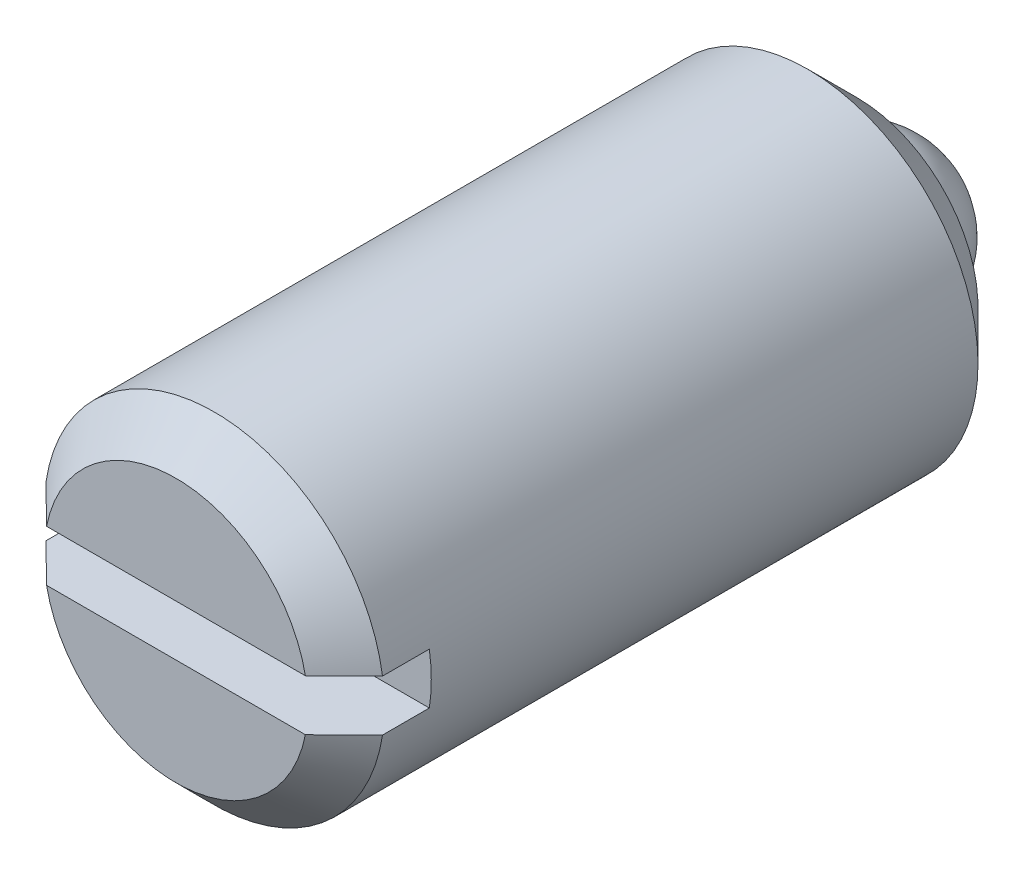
ISO-10303-21;
HEADER;
FILE_DESCRIPTION(('STEP AP214'),'2;1');
FILE_NAME('part.step','',(''),(''),'','','');
FILE_SCHEMA(('AUTOMOTIVE_DESIGN { 1 0 10303 214 1 1 1 1 }'));
ENDSEC;
DATA;
#1=APPLICATION_CONTEXT('core data for automotive mechanical design processes');
#2=APPLICATION_PROTOCOL_DEFINITION('international standard','automotive_design',2000,#1);
#3=PRODUCT_CONTEXT('',#1,'mechanical');
#4=PRODUCT('Part','Part','',(#3));
#5=PRODUCT_RELATED_PRODUCT_CATEGORY('part','',(#4));
#6=PRODUCT_DEFINITION_FORMATION('','',#4);
#7=PRODUCT_DEFINITION_CONTEXT('part definition',#1,'design');
#8=PRODUCT_DEFINITION('design','',#6,#7);
#9=PRODUCT_DEFINITION_SHAPE('','',#8);
#10=(LENGTH_UNIT() NAMED_UNIT(*) SI_UNIT(.MILLI.,.METRE.));
#11=(NAMED_UNIT(*) PLANE_ANGLE_UNIT() SI_UNIT($,.RADIAN.));
#12=(NAMED_UNIT(*) SI_UNIT($,.STERADIAN.) SOLID_ANGLE_UNIT());
#13=UNCERTAINTY_MEASURE_WITH_UNIT(LENGTH_MEASURE(1.E-05),#10,'distance_accuracy_value','');
#14=(GEOMETRIC_REPRESENTATION_CONTEXT(3) GLOBAL_UNCERTAINTY_ASSIGNED_CONTEXT((#13)) GLOBAL_UNIT_ASSIGNED_CONTEXT((#10,
#11,#12)) REPRESENTATION_CONTEXT('',''));
#15=CARTESIAN_POINT('',(0.,0.,0.));
#16=DIRECTION('',(0.,0.,1.));
#17=DIRECTION('',(1.,0.,0.));
#18=AXIS2_PLACEMENT_3D('',#15,#16,#17);
#19=CARTESIAN_POINT('',(0.,4.,18.));
#20=DIRECTION('',(0.,0.,1.));
#21=DIRECTION('',(1.,0.,0.));
#22=AXIS2_PLACEMENT_3D('',#19,#20,#21);
#23=PLANE('',#22);
#24=DIRECTION('',(1.,0.,0.));
#25=VECTOR('',#24,1.);
#26=CARTESIAN_POINT('',(-3.95474398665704,0.6,18.));
#27=LINE('',#26,#25);
#28=CARTESIAN_POINT('',(-3.04138126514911,0.6,18.));
#29=VERTEX_POINT('',#28);
#30=CARTESIAN_POINT('',(3.04138126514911,0.6,18.));
#31=VERTEX_POINT('',#30);
#32=EDGE_CURVE('E75',#29,#31,#27,.T.);
#33=ORIENTED_EDGE('',*,*,#32,.T.);
#34=CARTESIAN_POINT('',(0.,0.,18.));
#35=DIRECTION('',(0.,0.,1.));
#36=DIRECTION('',(0.,-1.,0.));
#37=AXIS2_PLACEMENT_3D('',#34,#35,#36);
#38=CIRCLE('',#37,3.1);
#39=EDGE_CURVE('E164',#31,#29,#38,.T.);
#40=ORIENTED_EDGE('',*,*,#39,.T.);
#41=EDGE_LOOP('',(#33,#40));
#42=FACE_BOUND('',#41,.T.);
#43=ADVANCED_FACE('F14',(#42),#23,.T.);
#44=CARTESIAN_POINT('',(0.,0.,-8.));
#45=DIRECTION('',(0.,0.,-1.));
#46=DIRECTION('',(-1.,0.,0.));
#47=AXIS2_PLACEMENT_3D('',#44,#45,#46);
#48=CYLINDRICAL_SURFACE('',#47,4.);
#49=CARTESIAN_POINT('',(0.,0.,3.15));
#50=DIRECTION('',(0.,0.,-1.));
#51=DIRECTION('',(0.,1.,0.));
#52=AXIS2_PLACEMENT_3D('',#49,#50,#51);
#53=CIRCLE('',#52,4.);
#54=CARTESIAN_POINT('',(0.,4.,3.15));
#55=VERTEX_POINT('',#54);
#56=EDGE_CURVE('E103',#55,#55,#53,.F.);
#57=ORIENTED_EDGE('',*,*,#56,.T.);
#58=EDGE_LOOP('',(#57));
#59=FACE_BOUND('',#58,.T.);
#60=DIRECTION('',(0.,0.,1.));
#61=VECTOR('',#60,1.);
#62=CARTESIAN_POINT('',(-3.95474398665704,0.6,16.));
#63=LINE('',#62,#61);
#64=CARTESIAN_POINT('',(-3.95474398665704,0.6,16.));
#65=VERTEX_POINT('',#64);
#66=CARTESIAN_POINT('',(-3.95474398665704,0.6,17.1));
#67=VERTEX_POINT('',#66);
#68=EDGE_CURVE('E95',#65,#67,#63,.T.);
#69=ORIENTED_EDGE('',*,*,#68,.T.);
#70=CARTESIAN_POINT('',(0.,0.,17.1));
#71=DIRECTION('',(0.,0.,1.));
#72=DIRECTION('',(0.,-1.,0.));
#73=AXIS2_PLACEMENT_3D('',#70,#71,#72);
#74=CIRCLE('',#73,4.);
#75=CARTESIAN_POINT('',(3.95474398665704,0.6,17.1));
#76=VERTEX_POINT('',#75);
#77=EDGE_CURVE('E107',#67,#76,#74,.F.);
#78=ORIENTED_EDGE('',*,*,#77,.T.);
#79=DIRECTION('',(0.,0.,1.));
#80=VECTOR('',#79,1.);
#81=CARTESIAN_POINT('',(3.95474398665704,0.6,16.));
#82=LINE('',#81,#80);
#83=CARTESIAN_POINT('',(3.95474398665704,0.6,16.));
#84=VERTEX_POINT('',#83);
#85=EDGE_CURVE('E89',#84,#76,#82,.T.);
#86=ORIENTED_EDGE('',*,*,#85,.F.);
#87=CARTESIAN_POINT('',(0.,0.,16.));
#88=DIRECTION('',(0.,0.,1.));
#89=DIRECTION('',(1.,0.,0.));
#90=AXIS2_PLACEMENT_3D('',#87,#88,#89);
#91=CIRCLE('',#90,4.);
#92=CARTESIAN_POINT('',(3.95474398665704,-0.6,16.));
#93=VERTEX_POINT('',#92);
#94=EDGE_CURVE('E77',#93,#84,#91,.T.);
#95=ORIENTED_EDGE('',*,*,#94,.F.);
#96=DIRECTION('',(0.,0.,1.));
#97=VECTOR('',#96,1.);
#98=CARTESIAN_POINT('',(3.95474398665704,-0.6,16.));
#99=LINE('',#98,#97);
#100=CARTESIAN_POINT('',(3.95474398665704,-0.6,17.1));
#101=VERTEX_POINT('',#100);
#102=EDGE_CURVE('E81',#93,#101,#99,.T.);
#103=ORIENTED_EDGE('',*,*,#102,.T.);
#104=CARTESIAN_POINT('',(0.,0.,17.1));
#105=DIRECTION('',(0.,0.,1.));
#106=DIRECTION('',(0.,-1.,0.));
#107=AXIS2_PLACEMENT_3D('',#104,#105,#106);
#108=CIRCLE('',#107,4.);
#109=CARTESIAN_POINT('',(-3.95474398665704,-0.6,17.1));
#110=VERTEX_POINT('',#109);
#111=EDGE_CURVE('E87',#101,#110,#108,.F.);
#112=ORIENTED_EDGE('',*,*,#111,.T.);
#113=DIRECTION('',(0.,0.,1.));
#114=VECTOR('',#113,1.);
#115=CARTESIAN_POINT('',(-3.95474398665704,-0.6,16.));
#116=LINE('',#115,#114);
#117=CARTESIAN_POINT('',(-3.95474398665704,-0.6,16.));
#118=VERTEX_POINT('',#117);
#119=EDGE_CURVE('E79',#118,#110,#116,.T.);
#120=ORIENTED_EDGE('',*,*,#119,.F.);
#121=EDGE_CURVE('E65',#65,#118,#91,.T.);
#122=ORIENTED_EDGE('',*,*,#121,.F.);
#123=EDGE_LOOP('',(#69,#78,#86,#95,#103,#112,#120,#122));
#124=FACE_BOUND('',#123,.T.);
#125=ADVANCED_FACE('F85',(#59,#124),#48,.T.);
#126=CARTESIAN_POINT('',(0.,0.,2.));
#127=DIRECTION('',(-1.,0.,0.));
#128=DIRECTION('',(0.,0.,1.));
#129=AXIS2_PLACEMENT_3D('',#126,#127,#128);
#130=SPHERICAL_SURFACE('',#129,2.);
#131=CARTESIAN_POINT('',(0.,0.,2.));
#132=DIRECTION('',(0.,0.,-1.));
#133=DIRECTION('',(-1.,0.,0.));
#134=AXIS2_PLACEMENT_3D('',#131,#132,#133);
#135=SPHERICAL_SURFACE('',#134,2.);
#136=CARTESIAN_POINT('',(0.,0.,2.));
#137=DIRECTION('',(0.,0.,-1.));
#138=DIRECTION('',(-1.,0.,0.));
#139=AXIS2_PLACEMENT_3D('',#136,#137,#138);
#140=CIRCLE('',#139,2.);
#141=CARTESIAN_POINT('',(-2.,0.,2.));
#142=VERTEX_POINT('',#141);
#143=EDGE_CURVE('E97',#142,#142,#140,.T.);
#144=ORIENTED_EDGE('',*,*,#143,.T.);
#145=EDGE_LOOP('',(#144));
#146=FACE_BOUND('',#145,.T.);
#147=ADVANCED_FACE('F137',(#146),#135,.T.);
#148=DIRECTION('',(1.,0.,0.));
#149=VECTOR('',#148,1.);
#150=CARTESIAN_POINT('',(-3.95474398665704,-0.6,18.));
#151=LINE('',#150,#149);
#152=CARTESIAN_POINT('',(-3.04138126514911,-0.6,18.));
#153=VERTEX_POINT('',#152);
#154=CARTESIAN_POINT('',(3.04138126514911,-0.6,18.));
#155=VERTEX_POINT('',#154);
#156=EDGE_CURVE('E166',#153,#155,#151,.T.);
#157=ORIENTED_EDGE('',*,*,#156,.F.);
#158=CARTESIAN_POINT('',(0.,0.,18.));
#159=DIRECTION('',(0.,0.,1.));
#160=DIRECTION('',(0.,-1.,0.));
#161=AXIS2_PLACEMENT_3D('',#158,#159,#160);
#162=CIRCLE('',#161,3.1);
#163=EDGE_CURVE('E9',#153,#155,#162,.T.);
#164=ORIENTED_EDGE('',*,*,#163,.T.);
#165=EDGE_LOOP('',(#157,#164));
#166=FACE_BOUND('',#165,.T.);
#167=ADVANCED_FACE('F140',(#166),#23,.T.);
#168=CARTESIAN_POINT('',(0.,2.,2.));
#169=DIRECTION('',(0.,0.,-1.));
#170=DIRECTION('',(-1.,0.,0.));
#171=AXIS2_PLACEMENT_3D('',#168,#169,#170);
#172=PLANE('',#171);
#173=CARTESIAN_POINT('',(0.,0.,2.));
#174=DIRECTION('',(0.,0.,-1.));
#175=DIRECTION('',(0.,1.,0.));
#176=AXIS2_PLACEMENT_3D('',#173,#174,#175);
#177=CIRCLE('',#176,2.85);
#178=CARTESIAN_POINT('',(0.,2.85,2.));
#179=VERTEX_POINT('',#178);
#180=EDGE_CURVE('E100',#179,#179,#177,.T.);
#181=ORIENTED_EDGE('',*,*,#180,.T.);
#182=EDGE_LOOP('',(#181));
#183=FACE_BOUND('',#182,.T.);
#184=ORIENTED_EDGE('',*,*,#143,.F.);
#185=EDGE_LOOP('',(#184));
#186=FACE_BOUND('',#185,.T.);
#187=ADVANCED_FACE('F144',(#183,#186),#172,.T.);
#188=CARTESIAN_POINT('',(-3.95474398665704,0.6,16.));
#189=DIRECTION('',(0.,-1.,0.));
#190=DIRECTION('',(1.,0.,0.));
#191=AXIS2_PLACEMENT_3D('',#188,#189,#190);
#192=PLANE('',#191);
#193=ORIENTED_EDGE('',*,*,#85,.T.);
#194=CARTESIAN_POINT('',(3.95474398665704,0.6,17.1));
#195=CARTESIAN_POINT('',(3.87875606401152,0.6,17.1751274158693));
#196=CARTESIAN_POINT('',(3.80274454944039,0.6,17.2502309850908));
#197=CARTESIAN_POINT('',(3.65066332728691,0.6,17.4003790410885));
#198=CARTESIAN_POINT('',(3.57459361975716,0.6,17.4754235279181));
#199=CARTESIAN_POINT('',(3.42238484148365,0.6,17.625442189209));
#200=CARTESIAN_POINT('',(3.34624577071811,0.6,17.7004163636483));
#201=CARTESIAN_POINT('',(3.19388188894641,0.6,17.8502776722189));
#202=CARTESIAN_POINT('',(3.11765707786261,0.6,17.9251648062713));
#203=CARTESIAN_POINT('',(3.04138126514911,0.6,18.));
#204=B_SPLINE_CURVE_WITH_KNOTS('',3,(#194,#195,#196,#197,#198,#199,#200,#201,#202,#203),
.UNSPECIFIED.,.F.,.F.,(4,2,2,2,4),(0.,0.32056924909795,0.641138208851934,0.96170726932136,
1.28227662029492),.UNSPECIFIED.);
#205=EDGE_CURVE('E117',#76,#31,#204,.T.);
#206=ORIENTED_EDGE('',*,*,#205,.T.);
#207=ORIENTED_EDGE('',*,*,#32,.F.);
#208=CARTESIAN_POINT('',(-3.04138126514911,0.6,18.));
#209=CARTESIAN_POINT('',(-3.11765707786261,0.6,17.9251648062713));
#210=CARTESIAN_POINT('',(-3.19388188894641,0.6,17.8502776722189));
#211=CARTESIAN_POINT('',(-3.34624577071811,0.6,17.7004163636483));
#212=CARTESIAN_POINT('',(-3.42238484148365,0.6,17.625442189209));
#213=CARTESIAN_POINT('',(-3.57459361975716,0.6,17.4754235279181));
#214=CARTESIAN_POINT('',(-3.65066332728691,0.6,17.4003790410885));
#215=CARTESIAN_POINT('',(-3.80274454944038,0.6,17.2502309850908));
#216=CARTESIAN_POINT('',(-3.87875606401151,0.6,17.1751274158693));
#217=CARTESIAN_POINT('',(-3.95474398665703,0.6,17.1));
#218=B_SPLINE_CURVE_WITH_KNOTS('',3,(#208,#209,#210,#211,#212,#213,#214,#215,#216,#217),
.UNSPECIFIED.,.F.,.F.,(4,2,2,2,4),(0.,0.320569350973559,0.641138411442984,0.961707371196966,
1.28227662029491),.UNSPECIFIED.);
#219=EDGE_CURVE('E110',#29,#67,#218,.T.);
#220=ORIENTED_EDGE('',*,*,#219,.T.);
#221=ORIENTED_EDGE('',*,*,#68,.F.);
#222=DIRECTION('',(1.,0.,0.));
#223=VECTOR('',#222,1.);
#224=CARTESIAN_POINT('',(-3.95474398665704,0.6,16.));
#225=LINE('',#224,#223);
#226=EDGE_CURVE('E71',#65,#84,#225,.T.);
#227=ORIENTED_EDGE('',*,*,#226,.T.);
#228=EDGE_LOOP('',(#193,#206,#207,#220,#221,#227));
#229=FACE_BOUND('',#228,.T.);
#230=ADVANCED_FACE('F123',(#229),#192,.T.);
#231=CARTESIAN_POINT('',(-3.95474398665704,-0.6,16.));
#232=DIRECTION('',(0.,-1.,0.));
#233=DIRECTION('',(1.,0.,0.));
#234=AXIS2_PLACEMENT_3D('',#231,#232,#233);
#235=PLANE('',#234);
#236=ORIENTED_EDGE('',*,*,#119,.T.);
#237=CARTESIAN_POINT('',(-3.95474398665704,-0.6,17.1));
#238=CARTESIAN_POINT('',(-3.87875606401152,-0.6,17.1751274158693));
#239=CARTESIAN_POINT('',(-3.80274454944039,-0.6,17.2502309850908));
#240=CARTESIAN_POINT('',(-3.65066332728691,-0.6,17.4003790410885));
#241=CARTESIAN_POINT('',(-3.57459361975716,-0.6,17.4754235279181));
#242=CARTESIAN_POINT('',(-3.42238484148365,-0.6,17.625442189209));
#243=CARTESIAN_POINT('',(-3.34624577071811,-0.6,17.7004163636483));
#244=CARTESIAN_POINT('',(-3.19388188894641,-0.6,17.8502776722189));
#245=CARTESIAN_POINT('',(-3.11765707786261,-0.6,17.9251648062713));
#246=CARTESIAN_POINT('',(-3.04138126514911,-0.6,18.));
#247=B_SPLINE_CURVE_WITH_KNOTS('',3,(#237,#238,#239,#240,#241,#242,#243,#244,#245,#246),
.UNSPECIFIED.,.F.,.F.,(4,2,2,2,4),(0.,0.32056924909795,0.641138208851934,0.96170726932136,
1.28227662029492),.UNSPECIFIED.);
#248=EDGE_CURVE('E23',#110,#153,#247,.T.);
#249=ORIENTED_EDGE('',*,*,#248,.T.);
#250=ORIENTED_EDGE('',*,*,#156,.T.);
#251=CARTESIAN_POINT('',(3.04138126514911,-0.6,18.));
#252=CARTESIAN_POINT('',(3.11765707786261,-0.6,17.9251648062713));
#253=CARTESIAN_POINT('',(3.19388188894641,-0.6,17.8502776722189));
#254=CARTESIAN_POINT('',(3.34624577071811,-0.6,17.7004163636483));
#255=CARTESIAN_POINT('',(3.42238484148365,-0.6,17.625442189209));
#256=CARTESIAN_POINT('',(3.57459361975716,-0.6,17.4754235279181));
#257=CARTESIAN_POINT('',(3.65066332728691,-0.6,17.4003790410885));
#258=CARTESIAN_POINT('',(3.80274454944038,-0.6,17.2502309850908));
#259=CARTESIAN_POINT('',(3.87875606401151,-0.6,17.1751274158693));
#260=CARTESIAN_POINT('',(3.95474398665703,-0.6,17.1));
#261=B_SPLINE_CURVE_WITH_KNOTS('',3,(#251,#252,#253,#254,#255,#256,#257,#258,#259,#260),
.UNSPECIFIED.,.F.,.F.,(4,2,2,2,4),(0.,0.320569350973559,0.641138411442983,0.961707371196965,
1.28227662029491),.UNSPECIFIED.);
#262=EDGE_CURVE('E169',#155,#101,#261,.T.);
#263=ORIENTED_EDGE('',*,*,#262,.T.);
#264=ORIENTED_EDGE('',*,*,#102,.F.);
#265=DIRECTION('',(1.,0.,0.));
#266=VECTOR('',#265,1.);
#267=CARTESIAN_POINT('',(-3.95474398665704,-0.6,16.));
#268=LINE('',#267,#266);
#269=EDGE_CURVE('E68',#118,#93,#268,.T.);
#270=ORIENTED_EDGE('',*,*,#269,.F.);
#271=EDGE_LOOP('',(#236,#249,#250,#263,#264,#270));
#272=FACE_BOUND('',#271,.T.);
#273=ADVANCED_FACE('F78',(#272),#235,.F.);
#274=CARTESIAN_POINT('',(0.,0.,16.));
#275=DIRECTION('',(0.,0.,1.));
#276=DIRECTION('',(1.,0.,0.));
#277=AXIS2_PLACEMENT_3D('',#274,#275,#276);
#278=PLANE('',#277);
#279=ORIENTED_EDGE('',*,*,#121,.T.);
#280=ORIENTED_EDGE('',*,*,#269,.T.);
#281=ORIENTED_EDGE('',*,*,#94,.T.);
#282=ORIENTED_EDGE('',*,*,#226,.F.);
#283=EDGE_LOOP('',(#279,#280,#281,#282));
#284=FACE_BOUND('',#283,.T.);
#285=ADVANCED_FACE('F67',(#284),#278,.T.);
#286=CARTESIAN_POINT('',(0.,0.,2.));
#287=DIRECTION('',(0.,0.,1.));
#288=DIRECTION('',(0.,-1.,0.));
#289=AXIS2_PLACEMENT_3D('',#286,#287,#288);
#290=CONICAL_SURFACE('',#289,2.85,0.785398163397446);
#291=ORIENTED_EDGE('',*,*,#56,.F.);
#292=EDGE_LOOP('',(#291));
#293=FACE_BOUND('',#292,.T.);
#294=ORIENTED_EDGE('',*,*,#180,.F.);
#295=EDGE_LOOP('',(#294));
#296=FACE_BOUND('',#295,.T.);
#297=ADVANCED_FACE('F131',(#293,#296),#290,.T.);
#298=CARTESIAN_POINT('',(0.,0.,17.1));
#299=DIRECTION('',(0.,0.,-1.));
#300=DIRECTION('',(0.,1.,0.));
#301=AXIS2_PLACEMENT_3D('',#298,#299,#300);
#302=CONICAL_SURFACE('',#301,4.,0.78539816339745);
#303=ORIENTED_EDGE('',*,*,#219,.F.);
#304=ORIENTED_EDGE('',*,*,#39,.F.);
#305=ORIENTED_EDGE('',*,*,#205,.F.);
#306=ORIENTED_EDGE('',*,*,#77,.F.);
#307=EDGE_LOOP('',(#303,#304,#305,#306));
#308=FACE_BOUND('',#307,.T.);
#309=ADVANCED_FACE('F127',(#308),#302,.T.);
#310=CARTESIAN_POINT('',(0.,0.,17.1));
#311=DIRECTION('',(0.,0.,-1.));
#312=DIRECTION('',(0.,1.,0.));
#313=AXIS2_PLACEMENT_3D('',#310,#311,#312);
#314=CONICAL_SURFACE('',#313,4.,0.78539816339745);
#315=ORIENTED_EDGE('',*,*,#262,.F.);
#316=ORIENTED_EDGE('',*,*,#163,.F.);
#317=ORIENTED_EDGE('',*,*,#248,.F.);
#318=ORIENTED_EDGE('',*,*,#111,.F.);
#319=EDGE_LOOP('',(#315,#316,#317,#318));
#320=FACE_BOUND('',#319,.T.);
#321=ADVANCED_FACE('F16',(#320),#314,.T.);
#322=CLOSED_SHELL('',(#43,#125,#147,#167,#187,#230,#273,#285,#297,#309,#321));
#323=MANIFOLD_SOLID_BREP('B1',#322);
#324=ADVANCED_BREP_SHAPE_REPRESENTATION('',(#18,#323),#14);
#325=SHAPE_DEFINITION_REPRESENTATION(#9,#324);
ENDSEC;
END-ISO-10303-21;
